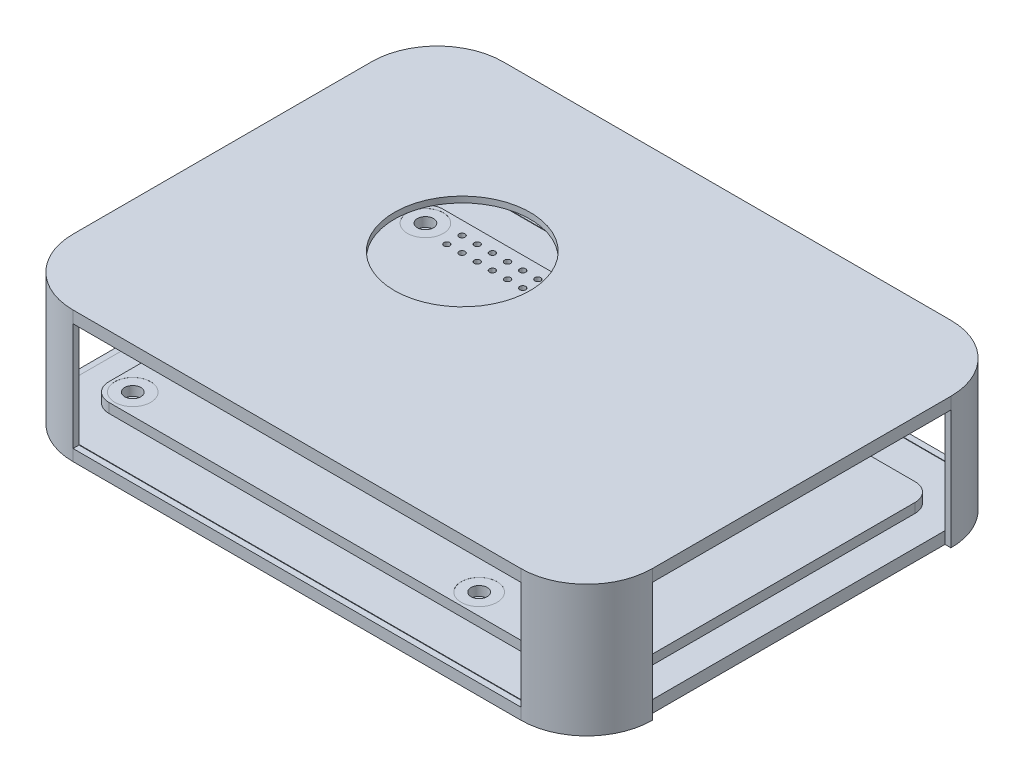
from build123d import *

# Parameters (mm, degrees)
BASES_W                    = 85
BASES_H                    = 56
BASE_DEPTH                 = 0.8
M2_5_CLEARANCE_HOLE_D      = 2.7
FASTENERAREA_START         = -0.01
FASTENERAREAS_R            = 3
FASTENERAREAS_R_2          = 1.35
FASTENERAREA_DEPTH         = 0.01
HLP_FASTENERHOLES_COUNT    = 2
HLP_FASTENERHOLES_PITCH    = 58
VM_FA_COPY_1_D             = 2.7
VM_START                   = -0.01
VM_FA_COPY_2_SKETCH_R      = 3
VM_FA_COPY_2_SKETCH_R_2    = 1.35
VM_FA_COPY_2_DEPTH         = 0.01
VM_FA_COPY_3_D             = 2.7
F_1_0_DIAMETER_HOLE_POE_D  = 1
LP_DIAHOLE_POE_COUNT       = 2
LP_DIAHOLE_POE_PITCH       = 2.54
LP_DIAHOLE_POE_COUNT_DIR2  = 2
LP_DIAHOLE_POE_PITCH_DIR2  = 2.54
F_1_0_1_DIAMETER_HOLE_IO_D = 1
LP_DIAHOLE_IO_COUNT        = 20
LP_DIAHOLE_IO_PITCH        = 2.54
LP_DIAHOLE_IO_COUNT_DIR2   = 2
LP_DIAHOLE_IO_PITCH_DIR2   = 2.54
J2CONNECTS_R               = 0.5
J2CONNECT_DEPTH            = 51.919642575
J2CONNECTLP_COUNT          = 2
J2CONNECTLP_PITCH          = 2.5
J2CONNECTLP_COL_COUNT      = 2
J2CONNECTLP_COL_PITCH      = 2.5
CORNERRADIUS_R             = 3
EXTRUDE_THIN1_DEPTH        = 2
EXTRUDE_THIN1_DEPTH_BACK   = 20
BOSS_EXTRUDE1_DEPTH        = 2
BOSS_EXTRUDE2_DEPTH        = 1
SKETCH13_R                 = 11.360688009
CUT_EXTRUDE1_DEPTH         = 1
SKETCH14_W                 = 75
SKETCH14_H                 = 18.091499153
CUT_EXTRUDE2_DEPTH         = 1
SKETCH15_W                 = 50
SKETCH15_H                 = 20
CUT_EXTRUDE3_DEPTH         = 1
SKETCH16_W                 = 75
SKETCH16_H                 = 17.916727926
CUT_EXTRUDE4_DEPTH         = 1
SKETCH17_W                 = 50
SKETCH17_H                 = 18.056378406
CUT_EXTRUDE5_DEPTH         = 1


with BuildPart() as part:
    # BaseS → Base (new, symmetric)
    with BuildSketch(Plane(origin=(0, 0, 0), x_dir=(1, 0, 0), z_dir=(0, 1, 0))):
        Rectangle(BASES_W, BASES_H)
    extrude(amount=BASE_DEPTH, both=True)

    # M2.5 Clearance Hole (through all)
    with Locations(Plane(origin=(0, 0.8, 0), x_dir=(1, 0, 0), z_dir=(0, 1, 0))):
        with Locations((-39, 24.5), (-39, -24.5)):
            m2_5_clearance_hole = Hole(M2_5_CLEARANCE_HOLE_D / 2)

    # FastenerAreaS → FastenerArea (cut)
    # profile 1 of 2: a face of its own
    with BuildSketch(Plane(origin=(0, 0.8, 0), x_dir=(1, 0, 0), z_dir=(0, 1, 0)).offset(FASTENERAREA_START)):
        with Locations(Location((-39, -24.5, 0), (0, 0, 270))):
            Circle(FASTENERAREAS_R)
        with Locations(Location((-39, -24.5, 0), (0, 0, 270))):
            Circle(FASTENERAREAS_R_2, mode=Mode.SUBTRACT)
    # profile 2 of 2: a face of its own
    with BuildSketch(Plane(origin=(0, 0.8, 0), x_dir=(1, 0, 0), z_dir=(0, 1, 0)).offset(FASTENERAREA_START)):
        with Locations(Location((-39, 24.5, 0), (0, 0, 270))):
            Circle(FASTENERAREAS_R)
        with Locations(Location((-39, 24.5, 0), (0, 0, 270))):
            Circle(FASTENERAREAS_R_2, mode=Mode.SUBTRACT)
    fastenerarea = extrude(amount=FASTENERAREA_DEPTH, mode=Mode.SUBTRACT)

    # HLP FastenerHoles: M2.5 Clearance Hole, FastenerArea ×2
    with Locations(*[(i * HLP_FASTENERHOLES_PITCH, 0, 0) for i in range(1, HLP_FASTENERHOLES_COUNT)]):
        add(m2_5_clearance_hole, mode=Mode.SUBTRACT)
        add(fastenerarea, mode=Mode.SUBTRACT)

    # VM FA: FastenerArea across plane
    add(fastenerarea.mirror(Plane.ZX), mode=Mode.SUBTRACT)

    # VM FA copy 1 (through all)
    with Locations(Plane(origin=(58, -0.8, 0), x_dir=(1, 0, 0), z_dir=(0, -1, 0))):
        with Locations((-39, -24.5), (-39, 24.5)):
            Hole(VM_FA_COPY_1_D / 2)

    # VM FA copy 2 sketch → VM FA copy 2 (cut)
    # profile 1 of 2: a face of its own
    with BuildSketch(Plane(origin=(58, -0.8, 0), x_dir=(1, 0, 0), z_dir=(0, -1, 0)).offset(VM_START)):
        with Locations((-39, 24.5)):
            Circle(VM_FA_COPY_2_SKETCH_R)
        with Locations((-39, 24.5)):
            Circle(VM_FA_COPY_2_SKETCH_R_2, mode=Mode.SUBTRACT)
    # profile 2 of 2: a face of its own
    with BuildSketch(Plane(origin=(58, -0.8, 0), x_dir=(1, 0, 0), z_dir=(0, -1, 0)).offset(VM_START)):
        with Locations((-39, -24.5)):
            Circle(VM_FA_COPY_2_SKETCH_R)
        with Locations((-39, -24.5)):
            Circle(VM_FA_COPY_2_SKETCH_R_2, mode=Mode.SUBTRACT)
    extrude(amount=VM_FA_COPY_2_DEPTH, mode=Mode.SUBTRACT)

    # VM FA copy 3 (through all)
    with Locations(Plane.XZ.offset(0.8)):
        with Locations((-39, -24.5), (-39, 24.5)):
            Hole(VM_FA_COPY_3_D / 2)

    # 1.0 Diameter Hole POE (through all)
    with Locations(Plane(origin=(0, 0.8, 0), x_dir=(1, 0, 0), z_dir=(0, 1, 0))):
        with Locations((20.27, 19.77)):
            f_1_0_diameter_hole_poe = Hole(F_1_0_DIAMETER_HOLE_POE_D / 2)

    # LP DiaHole POE: 1.0 Diameter Hole POE 2 × 2
    with Locations(*[(-i * LP_DIAHOLE_POE_PITCH, 0, j * LP_DIAHOLE_POE_PITCH_DIR2) for i in range(LP_DIAHOLE_POE_COUNT) for j in range(LP_DIAHOLE_POE_COUNT_DIR2) if (i, j) != (0, 0)]):
        add(f_1_0_diameter_hole_poe, mode=Mode.SUBTRACT)

    # 1.0 _1_ Diameter Hole IO (through all)
    with Locations(Plane(origin=(0, 0.8, 0), x_dir=(1, 0, 0), z_dir=(0, 1, 0))):
        with Locations((-34.13, 25.77)):
            f_1_0_1_diameter_hole_io = Hole(F_1_0_1_DIAMETER_HOLE_IO_D / 2)

    # LP DiaHole IO: 1.0 _1_ Diameter Hole IO 20 × 2
    with Locations(*[(i * LP_DIAHOLE_IO_PITCH, 0, j * LP_DIAHOLE_IO_PITCH_DIR2) for i in range(LP_DIAHOLE_IO_COUNT) for j in range(LP_DIAHOLE_IO_COUNT_DIR2) if (i, j) != (0, 0)]):
        add(f_1_0_1_diameter_hole_io, mode=Mode.SUBTRACT)

    # J2ConnectS → J2Connect (cut, through all)
    with BuildSketch(Plane(origin=(0, 0.8, 0), x_dir=(1, 0, 0), z_dir=(0, 1, 0))):
        with Locations(Location((-30.5, -7.5, 0), (0, 0, 270))):
            Circle(J2CONNECTS_R)
    j2connect = extrude(amount=-J2CONNECT_DEPTH, mode=Mode.SUBTRACT)

    # J2ConnectLP: J2Connect ×2
    with Locations(*[(i * J2CONNECTLP_PITCH, 0, 0) for i in range(1, J2CONNECTLP_COUNT)]):
        add(j2connect, mode=Mode.SUBTRACT)

    # J2ConnectLP col: J2Connect ×2
    with Locations(*[(-i * J2CONNECTLP_COL_PITCH, 0, 0) for i in range(1, J2CONNECTLP_COL_COUNT)]):
        add(j2connect, mode=Mode.SUBTRACT)

    # CornerRadius
    cornerradius_edges = [part.edges().sort_by_distance(p)[0] for p in [
        (42.5, 0, 28),
        (-42.5, 0, 28),
        (-42.5, 0, -28),
        (42.5, 0, -28),
    ]]
    fillet(cornerradius_edges, radius=CORNERRADIUS_R)

    # Sketch9_2 → Boss-Extrude1 (add)
    with BuildSketch(Plane.XZ.offset(0.8)):
        with BuildLine():
            Line((-37.5, 35), (37.5, 35))
            ThreePointArc((37.5, 35), (44.571067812, 32.071067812), (47.5, 25))
            Line((47.5, 25), (47.5, -25))
            ThreePointArc((47.5, -25), (44.571067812, -32.071067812), (37.5, -35))
            Line((37.5, -35), (-37.5, -35))
            ThreePointArc((-37.5, -35), (-44.571067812, -32.071067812), (-47.5, -25))
            Line((-47.5, -25), (-47.5, 25))
            ThreePointArc((-47.5, 25), (-44.571067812, 32.071067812), (-37.5, 35))
        make_face()
    extrude(amount=BOSS_EXTRUDE1_DEPTH)


with BuildPart() as body_2:
    # Sketch9 → Extrude-Thin1 (new, two sides: drawn at the far end of the back side and taken through both)
    with BuildSketch(Plane.XZ.offset(0.8).offset(-EXTRUDE_THIN1_DEPTH_BACK)):
        with BuildLine():
            Line((-37.5, 36), (37.5, 36))
            ThreePointArc((37.5, 36), (45.278174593, 32.778174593), (48.5, 25))
            Line((48.5, 25), (48.5, -25))
            ThreePointArc((48.5, -25), (45.278174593, -32.778174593), (37.5, -36))
            Line((37.5, -36), (-37.5, -36))
            ThreePointArc((-37.5, -36), (-45.278174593, -32.778174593), (-48.5, -25))
            Line((-48.5, -25), (-48.5, 25))
            ThreePointArc((-48.5, 25), (-45.278174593, 32.778174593), (-37.5, 36))
        make_face()
        with BuildLine():
            Line((-37.5, 35), (37.5, 35))
            ThreePointArc((37.5, 35), (44.571067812, 32.071067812), (47.5, 25))
            Line((47.5, 25), (47.5, -25))
            ThreePointArc((47.5, -25), (44.571067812, -32.071067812), (37.5, -35))
            Line((37.5, -35), (-37.5, -35))
            ThreePointArc((-37.5, -35), (-44.571067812, -32.071067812), (-47.5, -25))
            Line((-47.5, -25), (-47.5, 25))
            ThreePointArc((-47.5, 25), (-44.571067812, 32.071067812), (-37.5, 35))
        make_face(mode=Mode.SUBTRACT)
    extrude(amount=EXTRUDE_THIN1_DEPTH + EXTRUDE_THIN1_DEPTH_BACK)

    # Sketch12 → Boss-Extrude2 (add)
    with BuildSketch(Plane(origin=(0, 19.2, 0), x_dir=(1, 0, 0), z_dir=(0, 1, 0))):
        with BuildLine():
            Line((-37.5, 35), (37.5, 35))
            ThreePointArc((37.5, 35), (44.571067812, 32.071067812), (47.5, 25))
            Line((47.5, 25), (47.5, -25))
            ThreePointArc((47.5, -25), (44.571067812, -32.071067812), (37.5, -35))
            Line((37.5, -35), (-37.5, -35))
            ThreePointArc((-37.5, -35), (-44.571067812, -32.071067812), (-47.5, -25))
            Line((-47.5, -25), (-47.5, 25))
            ThreePointArc((-47.5, 25), (-44.571067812, 32.071067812), (-37.5, 35))
        make_face()
    extrude(amount=-BOSS_EXTRUDE2_DEPTH)

    # Sketch13 → Cut-Extrude1 (cut)
    with BuildSketch(Plane(origin=(0, 19.2, 0), x_dir=(1, 0, 0), z_dir=(0, 1, 0))):
        with Locations(Location((-13.398320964, 5.073628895, 0), (0, 0, 270))):
            Circle(SKETCH13_R)
    extrude(amount=-CUT_EXTRUDE1_DEPTH, mode=Mode.SUBTRACT)

    # Sketch14 → Cut-Extrude2 (cut)
    with BuildSketch(Plane.XY.offset(36)):
        with Locations((0, 8.154250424)):
            Rectangle(SKETCH14_W, SKETCH14_H)
    extrude(amount=-CUT_EXTRUDE2_DEPTH, mode=Mode.SUBTRACT)

    # Sketch15 → Cut-Extrude3 (cut)
    with BuildSketch(Plane(origin=(48.5, 0, 0), x_dir=(0, 0, -1), z_dir=(1, 0, 0))):
        with Locations((0, 7.2)):
            Rectangle(SKETCH15_W, SKETCH15_H)
    extrude(amount=-CUT_EXTRUDE3_DEPTH, mode=Mode.SUBTRACT)

    # Sketch16 → Cut-Extrude4 (cut)
    with BuildSketch(Plane(origin=(0, 0, -36), x_dir=(-1, 0, 0), z_dir=(0, 0, -1))):
        with Locations((0, 8.241636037)):
            Rectangle(SKETCH16_W, SKETCH16_H)
    extrude(amount=-CUT_EXTRUDE4_DEPTH, mode=Mode.SUBTRACT)

    # Sketch17 → Cut-Extrude5 (cut)
    with BuildSketch(Plane.ZY.offset(48.5)):
        with Locations((0, 8.171810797)):
            Rectangle(SKETCH17_W, SKETCH17_H)
    extrude(amount=-CUT_EXTRUDE5_DEPTH, mode=Mode.SUBTRACT)


solid = Compound([part.part, body_2.part])
